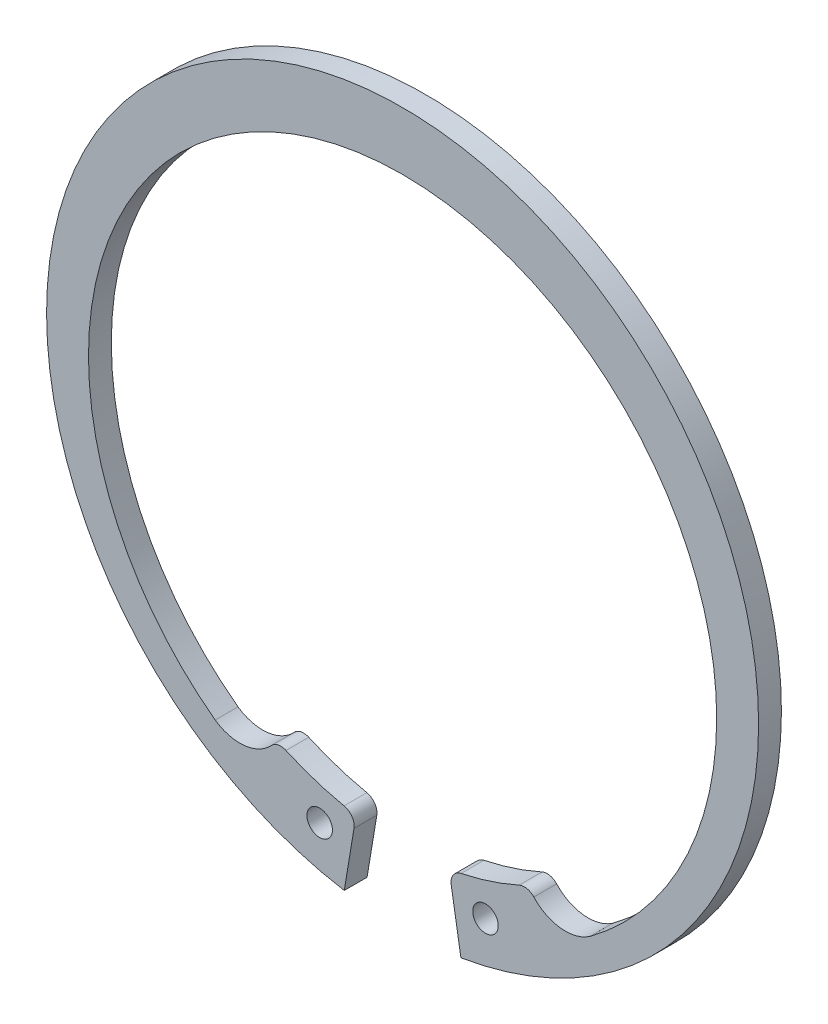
from build123d import *

# Parameters (mm, degrees)
BODYSKE_R    = 1.397
BODY_DEPTH   = 2.5
MODLUGSKE_R  = 1.397
MODLUG_DEPTH = 2.5


with BuildPart() as part:
    # BodySke → Body (new body)
    with BuildSketch(Plane.XY):
        with BuildLine():
            Line((6.389341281, -38.473059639), (5.641773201, -33.971620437))
            ThreePointArc((5.641773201, -33.971620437), (7.202963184, -30.462717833), (11.043110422, -30.517314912))
            ThreePointArc((11.043110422, -30.517314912), (14.894867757, -31.724886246), (18.770460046, -30.59614912))
            ThreePointArc((18.770460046, -30.59614912), (0, 32.65), (-18.770460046, -30.59614912))
            ThreePointArc((-18.770460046, -30.59614912), (-14.894867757, -31.724886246), (-11.043110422, -30.517314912))
            ThreePointArc((-11.043110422, -30.517314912), (-7.202963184, -30.462717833), (-5.641773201, -33.971620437))
            Line((-5.641773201, -33.971620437), (-6.389341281, -38.473059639))
            ThreePointArc((-6.389341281, -38.473059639), (0, 39), (6.389341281, -38.473059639))
        make_face()
        with Locations((9.081659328, -33.400347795)):
            Circle(BODYSKE_R, mode=Mode.SUBTRACT)
        with Locations((-9.081659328, -33.400347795)):
            Circle(BODYSKE_R, mode=Mode.SUBTRACT)
    extrude(amount=-BODY_DEPTH)

    # ModLugSke → ModLug (add, through all)
    # profile 1 of 2: a face of its own
    with BuildSketch(Plane.XY):
        with BuildLine():
            Line((6.389341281, -38.473059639), (5.323301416, -32.053960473))
            ThreePointArc((5.323301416, -32.053960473), (5.547914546, -31.037042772), (6.413571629, -30.458069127))
            ThreePointArc((6.413571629, -30.458069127), (9.649893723, -29.592354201), (12.774428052, -28.38383103))
            ThreePointArc((12.774428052, -28.38383103), (13.62639609, -28.288823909), (14.373448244, -28.709286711))
            ThreePointArc((14.373448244, -28.709286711), (17.325181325, -30.193414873), (20.525230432, -29.371800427))
            Line((20.525230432, -29.371800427), (22.339436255, -31.967946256))
            ThreePointArc((22.339436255, -31.967946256), (14.728027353, -36.112119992), (6.389341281, -38.473059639))
        make_face()
        with Locations((9.081659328, -33.400347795)):
            Circle(MODLUGSKE_R, mode=Mode.SUBTRACT)
    # profile 2 of 2: a face of its own
    with BuildSketch(Plane.XY):
        with BuildLine():
            Line((-6.389341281, -38.473059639), (-5.323301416, -32.053960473))
            ThreePointArc((-5.323301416, -32.053960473), (-5.547914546, -31.037042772), (-6.413571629, -30.458069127))
            ThreePointArc((-6.413571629, -30.458069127), (-9.649893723, -29.592354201), (-12.774428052, -28.38383103))
            ThreePointArc((-12.774428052, -28.38383103), (-13.62639609, -28.288823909), (-14.373448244, -28.709286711))
            ThreePointArc((-14.373448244, -28.709286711), (-17.325181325, -30.193414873), (-20.525230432, -29.371800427))
            Line((-20.525230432, -29.371800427), (-22.339436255, -31.967946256))
            ThreePointArc((-22.339436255, -31.967946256), (-14.728027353, -36.112119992), (-6.389341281, -38.473059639))
        make_face()
        with Locations((-9.081659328, -33.400347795)):
            Circle(MODLUGSKE_R, mode=Mode.SUBTRACT)
    extrude(amount=-MODLUG_DEPTH)


solid = part.part
